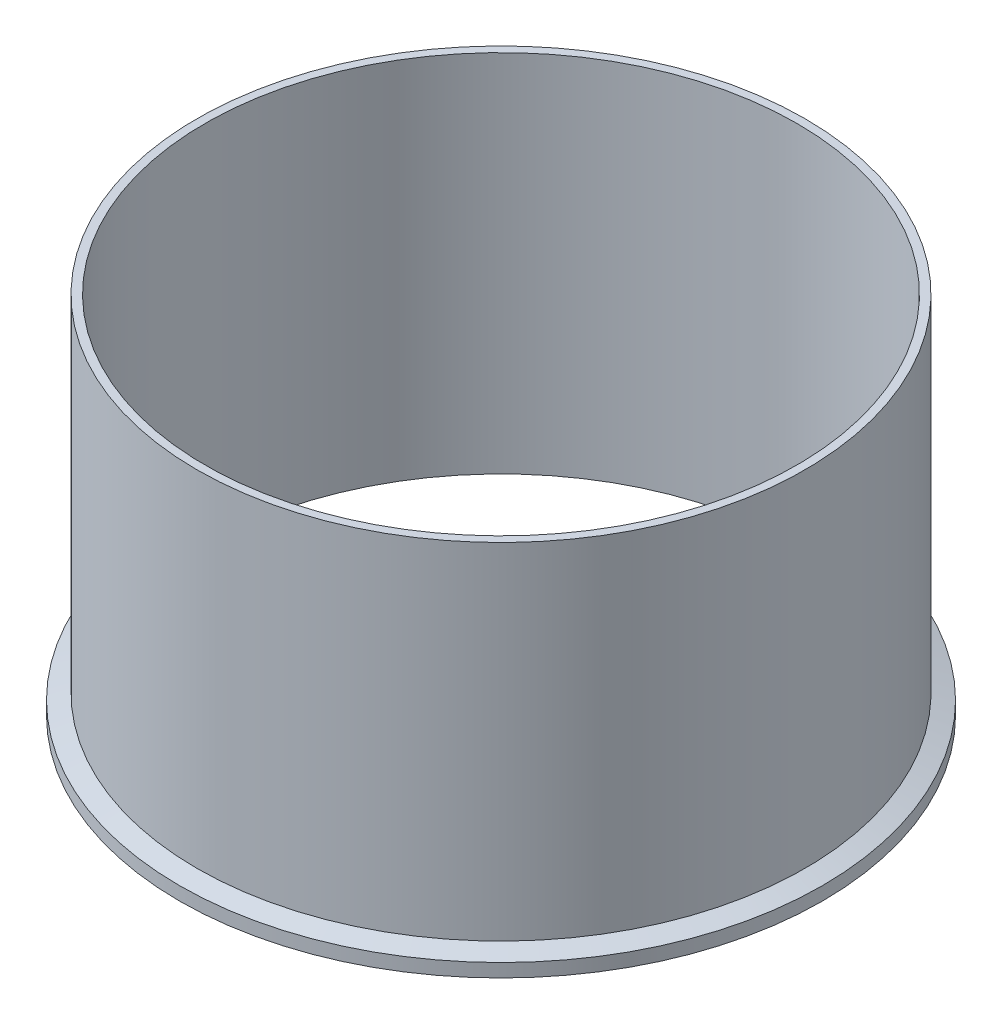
ISO-10303-21;
HEADER;
FILE_DESCRIPTION(('STEP AP214'),'2;1');
FILE_NAME('part.step','',(''),(''),'','','');
FILE_SCHEMA(('AUTOMOTIVE_DESIGN { 1 0 10303 214 1 1 1 1 }'));
ENDSEC;
DATA;
#1=APPLICATION_CONTEXT('core data for automotive mechanical design processes');
#2=APPLICATION_PROTOCOL_DEFINITION('international standard','automotive_design',2000,#1);
#3=PRODUCT_CONTEXT('',#1,'mechanical');
#4=PRODUCT('Part','Part','',(#3));
#5=PRODUCT_RELATED_PRODUCT_CATEGORY('part','',(#4));
#6=PRODUCT_DEFINITION_FORMATION('','',#4);
#7=PRODUCT_DEFINITION_CONTEXT('part definition',#1,'design');
#8=PRODUCT_DEFINITION('design','',#6,#7);
#9=PRODUCT_DEFINITION_SHAPE('','',#8);
#10=(LENGTH_UNIT() NAMED_UNIT(*) SI_UNIT(.MILLI.,.METRE.));
#11=(NAMED_UNIT(*) PLANE_ANGLE_UNIT() SI_UNIT($,.RADIAN.));
#12=(NAMED_UNIT(*) SI_UNIT($,.STERADIAN.) SOLID_ANGLE_UNIT());
#13=UNCERTAINTY_MEASURE_WITH_UNIT(LENGTH_MEASURE(1.E-05),#10,'distance_accuracy_value','');
#14=(GEOMETRIC_REPRESENTATION_CONTEXT(3) GLOBAL_UNCERTAINTY_ASSIGNED_CONTEXT((#13)) GLOBAL_UNIT_ASSIGNED_CONTEXT((#10,
#11,#12)) REPRESENTATION_CONTEXT('',''));
#15=CARTESIAN_POINT('',(0.,0.,0.));
#16=DIRECTION('',(0.,0.,1.));
#17=DIRECTION('',(1.,0.,0.));
#18=AXIS2_PLACEMENT_3D('',#15,#16,#17);
#19=CARTESIAN_POINT('',(0.,0.7874,0.));
#20=DIRECTION('',(0.,-1.,0.));
#21=DIRECTION('',(0.,0.,-1.));
#22=AXIS2_PLACEMENT_3D('',#19,#20,#21);
#23=TOROIDAL_SURFACE('',#22,130.799208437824,0.787400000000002);
#24=CARTESIAN_POINT('',(0.,0.,0.));
#25=DIRECTION('',(0.,-1.,0.));
#26=DIRECTION('',(0.,0.,-1.));
#27=AXIS2_PLACEMENT_3D('',#24,#25,#26);
#28=CIRCLE('',#27,130.799208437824);
#29=CARTESIAN_POINT('',(0.,0.,-130.799208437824));
#30=VERTEX_POINT('',#29);
#31=EDGE_CURVE('E67',#30,#30,#28,.T.);
#32=ORIENTED_EDGE('',*,*,#31,.T.);
#33=EDGE_LOOP('',(#32));
#34=FACE_BOUND('',#33,.T.);
#35=CARTESIAN_POINT('',(0.,0.474458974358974,0.));
#36=DIRECTION('',(0.,-1.,0.));
#37=DIRECTION('',(0.,0.,-1.));
#38=AXIS2_PLACEMENT_3D('',#35,#36,#37);
#39=CIRCLE('',#38,130.076666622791);
#40=CARTESIAN_POINT('',(0.,0.474458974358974,-130.076666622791));
#41=VERTEX_POINT('',#40);
#42=EDGE_CURVE('E10',#41,#41,#39,.T.);
#43=ORIENTED_EDGE('',*,*,#42,.F.);
#44=EDGE_LOOP('',(#43));
#45=FACE_BOUND('',#44,.T.);
#46=ADVANCED_FACE('F33',(#34,#45),#23,.T.);
#47=CARTESIAN_POINT('',(0.,0.,0.));
#48=DIRECTION('',(0.,-1.,0.));
#49=DIRECTION('',(0.,0.,-1.));
#50=AXIS2_PLACEMENT_3D('',#47,#48,#49);
#51=TOROIDAL_SURFACE('',#50,128.9812,1.1938);
#52=CARTESIAN_POINT('',(0.,0.474458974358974,0.));
#53=DIRECTION('',(0.,-1.,0.));
#54=DIRECTION('',(0.,0.,-1.));
#55=AXIS2_PLACEMENT_3D('',#52,#53,#54);
#56=CIRCLE('',#55,127.885733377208);
#57=CARTESIAN_POINT('',(0.,0.474458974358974,-127.885733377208));
#58=VERTEX_POINT('',#57);
#59=EDGE_CURVE('E39',#58,#58,#56,.T.);
#60=ORIENTED_EDGE('',*,*,#59,.F.);
#61=EDGE_LOOP('',(#60));
#62=FACE_BOUND('',#61,.T.);
#63=ORIENTED_EDGE('',*,*,#42,.T.);
#64=EDGE_LOOP('',(#63));
#65=FACE_BOUND('',#64,.T.);
#66=ADVANCED_FACE('F115',(#62,#65),#51,.F.);
#67=CARTESIAN_POINT('',(0.,0.7874,0.));
#68=DIRECTION('',(0.,-1.,0.));
#69=DIRECTION('',(0.,0.,-1.));
#70=AXIS2_PLACEMENT_3D('',#67,#68,#69);
#71=TOROIDAL_SURFACE('',#70,127.163191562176,0.787400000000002);
#72=ORIENTED_EDGE('',*,*,#59,.T.);
#73=EDGE_LOOP('',(#72));
#74=FACE_BOUND('',#73,.T.);
#75=CARTESIAN_POINT('',(0.,0.,0.));
#76=DIRECTION('',(0.,-1.,0.));
#77=DIRECTION('',(0.,0.,-1.));
#78=AXIS2_PLACEMENT_3D('',#75,#76,#77);
#79=CIRCLE('',#78,127.163191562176);
#80=CARTESIAN_POINT('',(0.,0.,-127.163191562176));
#81=VERTEX_POINT('',#80);
#82=EDGE_CURVE('E43',#81,#81,#79,.T.);
#83=ORIENTED_EDGE('',*,*,#82,.F.);
#84=EDGE_LOOP('',(#83));
#85=FACE_BOUND('',#84,.T.);
#86=ADVANCED_FACE('F111',(#74,#85),#71,.T.);
#87=CARTESIAN_POINT('',(0.,0.,0.));
#88=DIRECTION('',(0.,1.,0.));
#89=DIRECTION('',(0.,0.,1.));
#90=AXIS2_PLACEMENT_3D('',#87,#88,#89);
#91=PLANE('',#90);
#92=CARTESIAN_POINT('',(0.,0.,0.));
#93=DIRECTION('',(0.,-1.,0.));
#94=DIRECTION('',(0.,0.,-1.));
#95=AXIS2_PLACEMENT_3D('',#92,#93,#94);
#96=CIRCLE('',#95,123.5964);
#97=CARTESIAN_POINT('',(0.,0.,-123.5964));
#98=VERTEX_POINT('',#97);
#99=EDGE_CURVE('E47',#98,#98,#96,.T.);
#100=ORIENTED_EDGE('',*,*,#99,.F.);
#101=EDGE_LOOP('',(#100));
#102=FACE_BOUND('',#101,.T.);
#103=ORIENTED_EDGE('',*,*,#82,.T.);
#104=EDGE_LOOP('',(#103));
#105=FACE_BOUND('',#104,.T.);
#106=ADVANCED_FACE('F105',(#102,#105),#91,.F.);
#107=CARTESIAN_POINT('',(0.,0.,0.));
#108=DIRECTION('',(0.,-1.,0.));
#109=DIRECTION('',(0.,0.,-1.));
#110=AXIS2_PLACEMENT_3D('',#107,#108,#109);
#111=CYLINDRICAL_SURFACE('',#110,123.5964);
#112=ORIENTED_EDGE('',*,*,#99,.T.);
#113=EDGE_LOOP('',(#112));
#114=FACE_BOUND('',#113,.T.);
#115=CARTESIAN_POINT('',(0.,152.4,0.));
#116=DIRECTION('',(0.,-1.,0.));
#117=DIRECTION('',(0.,0.,-1.));
#118=AXIS2_PLACEMENT_3D('',#115,#116,#117);
#119=CIRCLE('',#118,123.5964);
#120=CARTESIAN_POINT('',(0.,152.4,-123.5964));
#121=VERTEX_POINT('',#120);
#122=EDGE_CURVE('E52',#121,#121,#119,.T.);
#123=ORIENTED_EDGE('',*,*,#122,.F.);
#124=EDGE_LOOP('',(#123));
#125=FACE_BOUND('',#124,.T.);
#126=ADVANCED_FACE('F100',(#114,#125),#111,.F.);
#127=CARTESIAN_POINT('',(0.,152.4,0.));
#128=DIRECTION('',(0.,-1.,0.));
#129=DIRECTION('',(0.,0.,-1.));
#130=AXIS2_PLACEMENT_3D('',#127,#128,#129);
#131=PLANE('',#130);
#132=CARTESIAN_POINT('',(0.,152.4,0.));
#133=DIRECTION('',(0.,-1.,0.));
#134=DIRECTION('',(0.,0.,-1.));
#135=AXIS2_PLACEMENT_3D('',#132,#133,#134);
#136=CIRCLE('',#135,127.);
#137=CARTESIAN_POINT('',(0.,152.4,-127.));
#138=VERTEX_POINT('',#137);
#139=EDGE_CURVE('E55',#138,#138,#136,.T.);
#140=ORIENTED_EDGE('',*,*,#139,.F.);
#141=EDGE_LOOP('',(#140));
#142=FACE_BOUND('',#141,.T.);
#143=ORIENTED_EDGE('',*,*,#122,.T.);
#144=EDGE_LOOP('',(#143));
#145=FACE_BOUND('',#144,.T.);
#146=ADVANCED_FACE('F94',(#142,#145),#131,.F.);
#147=CARTESIAN_POINT('',(0.,0.,0.));
#148=DIRECTION('',(0.,-1.,0.));
#149=DIRECTION('',(0.,0.,-1.));
#150=AXIS2_PLACEMENT_3D('',#147,#148,#149);
#151=CYLINDRICAL_SURFACE('',#150,127.);
#152=CARTESIAN_POINT('',(0.,8.22278052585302,0.));
#153=DIRECTION('',(0.,-1.,0.));
#154=DIRECTION('',(0.,0.,-1.));
#155=AXIS2_PLACEMENT_3D('',#152,#153,#154);
#156=CIRCLE('',#155,127.);
#157=CARTESIAN_POINT('',(0.,8.22278052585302,-127.));
#158=VERTEX_POINT('',#157);
#159=EDGE_CURVE('E58',#158,#158,#156,.T.);
#160=ORIENTED_EDGE('',*,*,#159,.F.);
#161=EDGE_LOOP('',(#160));
#162=FACE_BOUND('',#161,.T.);
#163=ORIENTED_EDGE('',*,*,#139,.T.);
#164=EDGE_LOOP('',(#163));
#165=FACE_BOUND('',#164,.T.);
#166=ADVANCED_FACE('F88',(#162,#165),#151,.T.);
#167=CARTESIAN_POINT('',(0.,8.22278052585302,0.));
#168=DIRECTION('',(0.,-1.,0.));
#169=DIRECTION('',(0.,0.,-1.));
#170=AXIS2_PLACEMENT_3D('',#167,#168,#169);
#171=CONICAL_SURFACE('',#170,127.,1.22173047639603);
#172=CARTESIAN_POINT('',(0.,5.58799999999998,0.));
#173=DIRECTION('',(0.,-1.,0.));
#174=DIRECTION('',(0.,0.,-1.));
#175=AXIS2_PLACEMENT_3D('',#172,#173,#174);
#176=CIRCLE('',#175,134.239);
#177=CARTESIAN_POINT('',(0.,5.58799999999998,-134.239));
#178=VERTEX_POINT('',#177);
#179=EDGE_CURVE('E61',#178,#178,#176,.T.);
#180=ORIENTED_EDGE('',*,*,#179,.F.);
#181=EDGE_LOOP('',(#180));
#182=FACE_BOUND('',#181,.T.);
#183=ORIENTED_EDGE('',*,*,#159,.T.);
#184=EDGE_LOOP('',(#183));
#185=FACE_BOUND('',#184,.T.);
#186=ADVANCED_FACE('F82',(#182,#185),#171,.T.);
#187=CARTESIAN_POINT('',(0.,0.,0.));
#188=DIRECTION('',(0.,-1.,0.));
#189=DIRECTION('',(0.,0.,-1.));
#190=AXIS2_PLACEMENT_3D('',#187,#188,#189);
#191=CYLINDRICAL_SURFACE('',#190,134.239);
#192=CARTESIAN_POINT('',(0.,0.,0.));
#193=DIRECTION('',(0.,-1.,0.));
#194=DIRECTION('',(0.,0.,-1.));
#195=AXIS2_PLACEMENT_3D('',#192,#193,#194);
#196=CIRCLE('',#195,134.239);
#197=CARTESIAN_POINT('',(0.,0.,-134.239));
#198=VERTEX_POINT('',#197);
#199=EDGE_CURVE('E64',#198,#198,#196,.T.);
#200=ORIENTED_EDGE('',*,*,#199,.F.);
#201=EDGE_LOOP('',(#200));
#202=FACE_BOUND('',#201,.T.);
#203=ORIENTED_EDGE('',*,*,#179,.T.);
#204=EDGE_LOOP('',(#203));
#205=FACE_BOUND('',#204,.T.);
#206=ADVANCED_FACE('F76',(#202,#205),#191,.T.);
#207=CARTESIAN_POINT('',(0.,0.,0.));
#208=DIRECTION('',(0.,1.,0.));
#209=DIRECTION('',(0.,0.,1.));
#210=AXIS2_PLACEMENT_3D('',#207,#208,#209);
#211=PLANE('',#210);
#212=ORIENTED_EDGE('',*,*,#31,.F.);
#213=EDGE_LOOP('',(#212));
#214=FACE_BOUND('',#213,.T.);
#215=ORIENTED_EDGE('',*,*,#199,.T.);
#216=EDGE_LOOP('',(#215));
#217=FACE_BOUND('',#216,.T.);
#218=ADVANCED_FACE('F73',(#214,#217),#211,.F.);
#219=CLOSED_SHELL('',(#46,#66,#86,#106,#126,#146,#166,#186,#206,#218));
#220=MANIFOLD_SOLID_BREP('B2',#219);
#221=ADVANCED_BREP_SHAPE_REPRESENTATION('',(#18,#220),#14);
#222=SHAPE_DEFINITION_REPRESENTATION(#9,#221);
ENDSEC;
END-ISO-10303-21;
